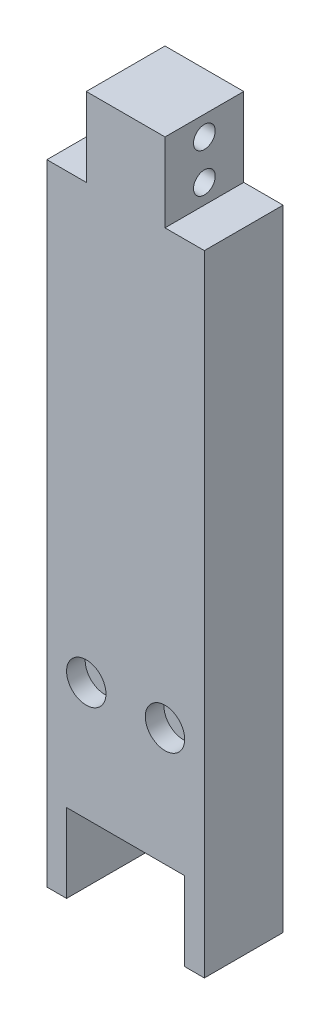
ISO-10303-21;
HEADER;
FILE_DESCRIPTION(('STEP AP214'),'2;1');
FILE_NAME('part.step','',(''),(''),'','','');
FILE_SCHEMA(('AUTOMOTIVE_DESIGN { 1 0 10303 214 1 1 1 1 }'));
ENDSEC;
DATA;
#1=APPLICATION_CONTEXT('core data for automotive mechanical design processes');
#2=APPLICATION_PROTOCOL_DEFINITION('international standard','automotive_design',2000,#1);
#3=PRODUCT_CONTEXT('',#1,'mechanical');
#4=PRODUCT('Part','Part','',(#3));
#5=PRODUCT_RELATED_PRODUCT_CATEGORY('part','',(#4));
#6=PRODUCT_DEFINITION_FORMATION('','',#4);
#7=PRODUCT_DEFINITION_CONTEXT('part definition',#1,'design');
#8=PRODUCT_DEFINITION('design','',#6,#7);
#9=PRODUCT_DEFINITION_SHAPE('','',#8);
#10=(LENGTH_UNIT() NAMED_UNIT(*) SI_UNIT(.MILLI.,.METRE.));
#11=(NAMED_UNIT(*) PLANE_ANGLE_UNIT() SI_UNIT($,.RADIAN.));
#12=(NAMED_UNIT(*) SI_UNIT($,.STERADIAN.) SOLID_ANGLE_UNIT());
#13=UNCERTAINTY_MEASURE_WITH_UNIT(LENGTH_MEASURE(1.E-05),#10,'distance_accuracy_value','');
#14=(GEOMETRIC_REPRESENTATION_CONTEXT(3) GLOBAL_UNCERTAINTY_ASSIGNED_CONTEXT((#13)) GLOBAL_UNIT_ASSIGNED_CONTEXT((#10,
#11,#12)) REPRESENTATION_CONTEXT('',''));
#15=CARTESIAN_POINT('',(0.,0.,0.));
#16=DIRECTION('',(0.,0.,1.));
#17=DIRECTION('',(1.,0.,0.));
#18=AXIS2_PLACEMENT_3D('',#15,#16,#17);
#19=CARTESIAN_POINT('',(12.7,-76.2,12.7));
#20=DIRECTION('',(0.,1.,0.));
#21=DIRECTION('',(0.,0.,1.));
#22=AXIS2_PLACEMENT_3D('',#19,#20,#21);
#23=PLANE('',#22);
#24=DIRECTION('',(1.,0.,0.));
#25=VECTOR('',#24,1.);
#26=CARTESIAN_POINT('',(12.7,-76.2,0.));
#27=LINE('',#26,#25);
#28=CARTESIAN_POINT('',(-12.7,-76.2,0.));
#29=VERTEX_POINT('',#28);
#30=CARTESIAN_POINT('',(-9.525,-76.2,0.));
#31=VERTEX_POINT('',#30);
#32=EDGE_CURVE('E165',#29,#31,#27,.T.);
#33=ORIENTED_EDGE('',*,*,#32,.T.);
#34=DIRECTION('',(0.,0.,-1.));
#35=VECTOR('',#34,1.);
#36=CARTESIAN_POINT('',(-9.525,-76.2,12.7));
#37=LINE('',#36,#35);
#38=CARTESIAN_POINT('',(-9.525,-76.2,12.7));
#39=VERTEX_POINT('',#38);
#40=EDGE_CURVE('E254',#39,#31,#37,.T.);
#41=ORIENTED_EDGE('',*,*,#40,.F.);
#42=DIRECTION('',(1.,0.,0.));
#43=VECTOR('',#42,1.);
#44=CARTESIAN_POINT('',(12.7,-76.2,12.7));
#45=LINE('',#44,#43);
#46=CARTESIAN_POINT('',(-12.7,-76.2,12.7));
#47=VERTEX_POINT('',#46);
#48=EDGE_CURVE('E115',#47,#39,#45,.T.);
#49=ORIENTED_EDGE('',*,*,#48,.F.);
#50=DIRECTION('',(0.,0.,-1.));
#51=VECTOR('',#50,1.);
#52=CARTESIAN_POINT('',(-12.7,-76.2,12.7));
#53=LINE('',#52,#51);
#54=EDGE_CURVE('E13',#47,#29,#53,.T.);
#55=ORIENTED_EDGE('',*,*,#54,.T.);
#56=EDGE_LOOP('',(#33,#41,#49,#55));
#57=FACE_BOUND('',#56,.T.);
#58=ADVANCED_FACE('F49',(#57),#23,.F.);
#59=CARTESIAN_POINT('',(-12.7,25.4,12.7));
#60=DIRECTION('',(1.,0.,0.));
#61=DIRECTION('',(0.,0.,-1.));
#62=AXIS2_PLACEMENT_3D('',#59,#60,#61);
#63=PLANE('',#62);
#64=DIRECTION('',(0.,-1.,0.));
#65=VECTOR('',#64,1.);
#66=CARTESIAN_POINT('',(-12.7,25.4,0.));
#67=LINE('',#66,#65);
#68=CARTESIAN_POINT('',(-12.7,25.4,0.));
#69=VERTEX_POINT('',#68);
#70=EDGE_CURVE('E160',#69,#29,#67,.T.);
#71=ORIENTED_EDGE('',*,*,#70,.T.);
#72=ORIENTED_EDGE('',*,*,#54,.F.);
#73=DIRECTION('',(0.,-1.,0.));
#74=VECTOR('',#73,1.);
#75=CARTESIAN_POINT('',(-12.7,25.4,12.7));
#76=LINE('',#75,#74);
#77=CARTESIAN_POINT('',(-12.7,25.4,12.7));
#78=VERTEX_POINT('',#77);
#79=EDGE_CURVE('E178',#78,#47,#76,.T.);
#80=ORIENTED_EDGE('',*,*,#79,.F.);
#81=DIRECTION('',(0.,0.,-1.));
#82=VECTOR('',#81,1.);
#83=CARTESIAN_POINT('',(-12.7,25.4,12.7));
#84=LINE('',#83,#82);
#85=EDGE_CURVE('E156',#78,#69,#84,.T.);
#86=ORIENTED_EDGE('',*,*,#85,.T.);
#87=EDGE_LOOP('',(#71,#72,#80,#86));
#88=FACE_BOUND('',#87,.T.);
#89=ADVANCED_FACE('F51',(#88),#63,.F.);
#90=CARTESIAN_POINT('',(9.525,-76.2,12.7));
#91=VERTEX_POINT('',#90);
#92=CARTESIAN_POINT('',(12.7,-76.2,12.7));
#93=VERTEX_POINT('',#92);
#94=EDGE_CURVE('E217',#91,#93,#45,.T.);
#95=ORIENTED_EDGE('',*,*,#94,.F.);
#96=DIRECTION('',(0.,0.,1.));
#97=VECTOR('',#96,1.);
#98=CARTESIAN_POINT('',(9.525,-76.2,12.7));
#99=LINE('',#98,#97);
#100=CARTESIAN_POINT('',(9.525,-76.2,0.));
#101=VERTEX_POINT('',#100);
#102=EDGE_CURVE('E251',#101,#91,#99,.T.);
#103=ORIENTED_EDGE('',*,*,#102,.F.);
#104=CARTESIAN_POINT('',(12.7,-76.2,0.));
#105=VERTEX_POINT('',#104);
#106=EDGE_CURVE('E163',#101,#105,#27,.T.);
#107=ORIENTED_EDGE('',*,*,#106,.T.);
#108=DIRECTION('',(0.,0.,-1.));
#109=VECTOR('',#108,1.);
#110=CARTESIAN_POINT('',(12.7,-76.2,12.7));
#111=LINE('',#110,#109);
#112=EDGE_CURVE('E58',#93,#105,#111,.T.);
#113=ORIENTED_EDGE('',*,*,#112,.F.);
#114=EDGE_LOOP('',(#95,#103,#107,#113));
#115=FACE_BOUND('',#114,.T.);
#116=ADVANCED_FACE('F309',(#115),#23,.F.);
#117=CARTESIAN_POINT('',(12.7,25.4,12.7));
#118=DIRECTION('',(-1.,0.,0.));
#119=DIRECTION('',(0.,0.,1.));
#120=AXIS2_PLACEMENT_3D('',#117,#118,#119);
#121=PLANE('',#120);
#122=DIRECTION('',(0.,1.,0.));
#123=VECTOR('',#122,1.);
#124=CARTESIAN_POINT('',(12.7,25.4,0.));
#125=LINE('',#124,#123);
#126=CARTESIAN_POINT('',(12.7,25.4,0.));
#127=VERTEX_POINT('',#126);
#128=EDGE_CURVE('E168',#105,#127,#125,.T.);
#129=ORIENTED_EDGE('',*,*,#128,.T.);
#130=DIRECTION('',(0.,0.,-1.));
#131=VECTOR('',#130,1.);
#132=CARTESIAN_POINT('',(12.7,25.4,12.7));
#133=LINE('',#132,#131);
#134=CARTESIAN_POINT('',(12.7,25.4,12.7));
#135=VERTEX_POINT('',#134);
#136=EDGE_CURVE('E185',#135,#127,#133,.T.);
#137=ORIENTED_EDGE('',*,*,#136,.F.);
#138=DIRECTION('',(0.,1.,0.));
#139=VECTOR('',#138,1.);
#140=CARTESIAN_POINT('',(12.7,25.4,12.7));
#141=LINE('',#140,#139);
#142=EDGE_CURVE('E195',#93,#135,#141,.T.);
#143=ORIENTED_EDGE('',*,*,#142,.F.);
#144=ORIENTED_EDGE('',*,*,#112,.T.);
#145=EDGE_LOOP('',(#129,#137,#143,#144));
#146=FACE_BOUND('',#145,.T.);
#147=ADVANCED_FACE('F193',(#146),#121,.F.);
#148=CARTESIAN_POINT('',(6.35,25.4,12.7));
#149=DIRECTION('',(0.,-1.,0.));
#150=DIRECTION('',(0.,0.,-1.));
#151=AXIS2_PLACEMENT_3D('',#148,#149,#150);
#152=PLANE('',#151);
#153=DIRECTION('',(-1.,0.,0.));
#154=VECTOR('',#153,1.);
#155=CARTESIAN_POINT('',(6.35,25.4,0.));
#156=LINE('',#155,#154);
#157=CARTESIAN_POINT('',(6.35,25.4,0.));
#158=VERTEX_POINT('',#157);
#159=EDGE_CURVE('E170',#127,#158,#156,.T.);
#160=ORIENTED_EDGE('',*,*,#159,.T.);
#161=DIRECTION('',(0.,0.,-1.));
#162=VECTOR('',#161,1.);
#163=CARTESIAN_POINT('',(6.35,25.4,12.7));
#164=LINE('',#163,#162);
#165=CARTESIAN_POINT('',(6.35,25.4,12.7));
#166=VERTEX_POINT('',#165);
#167=EDGE_CURVE('E182',#166,#158,#164,.T.);
#168=ORIENTED_EDGE('',*,*,#167,.F.);
#169=DIRECTION('',(-1.,0.,0.));
#170=VECTOR('',#169,1.);
#171=CARTESIAN_POINT('',(6.35,25.4,12.7));
#172=LINE('',#171,#170);
#173=EDGE_CURVE('E212',#135,#166,#172,.T.);
#174=ORIENTED_EDGE('',*,*,#173,.F.);
#175=ORIENTED_EDGE('',*,*,#136,.T.);
#176=EDGE_LOOP('',(#160,#168,#174,#175));
#177=FACE_BOUND('',#176,.T.);
#178=ADVANCED_FACE('F208',(#177),#152,.F.);
#179=CARTESIAN_POINT('',(6.35,38.1,12.7));
#180=DIRECTION('',(-1.,0.,0.));
#181=DIRECTION('',(0.,-1.,0.));
#182=AXIS2_PLACEMENT_3D('',#179,#180,#181);
#183=PLANE('',#182);
#184=CARTESIAN_POINT('',(6.35,28.575,6.35));
#185=DIRECTION('',(1.,0.,0.));
#186=DIRECTION('',(0.,1.,0.));
#187=AXIS2_PLACEMENT_3D('',#184,#185,#186);
#188=CIRCLE('',#187,1.7526);
#189=CARTESIAN_POINT('',(6.35,30.3276,6.35));
#190=VERTEX_POINT('',#189);
#191=EDGE_CURVE('E225',#190,#190,#188,.T.);
#192=ORIENTED_EDGE('',*,*,#191,.F.);
#193=EDGE_LOOP('',(#192));
#194=FACE_BOUND('',#193,.T.);
#195=CARTESIAN_POINT('',(6.35,34.9242400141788,6.35));
#196=DIRECTION('',(1.,0.,0.));
#197=DIRECTION('',(0.,1.,0.));
#198=AXIS2_PLACEMENT_3D('',#195,#196,#197);
#199=CIRCLE('',#198,1.7526);
#200=CARTESIAN_POINT('',(6.35,36.6768400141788,6.35));
#201=VERTEX_POINT('',#200);
#202=EDGE_CURVE('E219',#201,#201,#199,.T.);
#203=ORIENTED_EDGE('',*,*,#202,.F.);
#204=EDGE_LOOP('',(#203));
#205=FACE_BOUND('',#204,.T.);
#206=DIRECTION('',(0.,1.,0.));
#207=VECTOR('',#206,1.);
#208=CARTESIAN_POINT('',(6.35,38.1,0.));
#209=LINE('',#208,#207);
#210=CARTESIAN_POINT('',(6.35,38.1,0.));
#211=VERTEX_POINT('',#210);
#212=EDGE_CURVE('E172',#158,#211,#209,.T.);
#213=ORIENTED_EDGE('',*,*,#212,.T.);
#214=DIRECTION('',(0.,0.,-1.));
#215=VECTOR('',#214,1.);
#216=CARTESIAN_POINT('',(6.35,38.1,12.7));
#217=LINE('',#216,#215);
#218=CARTESIAN_POINT('',(6.35,38.1,12.7));
#219=VERTEX_POINT('',#218);
#220=EDGE_CURVE('E151',#219,#211,#217,.T.);
#221=ORIENTED_EDGE('',*,*,#220,.F.);
#222=DIRECTION('',(0.,1.,0.));
#223=VECTOR('',#222,1.);
#224=CARTESIAN_POINT('',(6.35,38.1,12.7));
#225=LINE('',#224,#223);
#226=EDGE_CURVE('E139',#166,#219,#225,.T.);
#227=ORIENTED_EDGE('',*,*,#226,.F.);
#228=ORIENTED_EDGE('',*,*,#167,.T.);
#229=EDGE_LOOP('',(#213,#221,#227,#228));
#230=FACE_BOUND('',#229,.T.);
#231=ADVANCED_FACE('F211',(#194,#205,#230),#183,.F.);
#232=CARTESIAN_POINT('',(6.35,38.1,12.7));
#233=DIRECTION('',(0.,-1.,0.));
#234=DIRECTION('',(0.,0.,-1.));
#235=AXIS2_PLACEMENT_3D('',#232,#233,#234);
#236=PLANE('',#235);
#237=DIRECTION('',(-1.,0.,0.));
#238=VECTOR('',#237,1.);
#239=CARTESIAN_POINT('',(6.35,38.1,0.));
#240=LINE('',#239,#238);
#241=CARTESIAN_POINT('',(-6.35,38.1,0.));
#242=VERTEX_POINT('',#241);
#243=EDGE_CURVE('E148',#211,#242,#240,.T.);
#244=ORIENTED_EDGE('',*,*,#243,.T.);
#245=DIRECTION('',(0.,0.,-1.));
#246=VECTOR('',#245,1.);
#247=CARTESIAN_POINT('',(-6.35,38.1,12.7));
#248=LINE('',#247,#246);
#249=CARTESIAN_POINT('',(-6.35,38.1,12.7));
#250=VERTEX_POINT('',#249);
#251=EDGE_CURVE('E145',#250,#242,#248,.T.);
#252=ORIENTED_EDGE('',*,*,#251,.F.);
#253=DIRECTION('',(-1.,0.,0.));
#254=VECTOR('',#253,1.);
#255=CARTESIAN_POINT('',(6.35,38.1,12.7));
#256=LINE('',#255,#254);
#257=EDGE_CURVE('E132',#219,#250,#256,.T.);
#258=ORIENTED_EDGE('',*,*,#257,.F.);
#259=ORIENTED_EDGE('',*,*,#220,.T.);
#260=EDGE_LOOP('',(#244,#252,#258,#259));
#261=FACE_BOUND('',#260,.T.);
#262=ADVANCED_FACE('F146',(#261),#236,.F.);
#263=CARTESIAN_POINT('',(-6.35,38.1,12.7));
#264=DIRECTION('',(1.,0.,0.));
#265=DIRECTION('',(0.,1.,0.));
#266=AXIS2_PLACEMENT_3D('',#263,#264,#265);
#267=PLANE('',#266);
#268=CARTESIAN_POINT('',(-6.35,28.575,6.35));
#269=DIRECTION('',(1.,0.,0.));
#270=DIRECTION('',(0.,1.,0.));
#271=AXIS2_PLACEMENT_3D('',#268,#269,#270);
#272=CIRCLE('',#271,1.7526);
#273=CARTESIAN_POINT('',(-6.35,30.3276,6.35));
#274=VERTEX_POINT('',#273);
#275=EDGE_CURVE('E222',#274,#274,#272,.T.);
#276=ORIENTED_EDGE('',*,*,#275,.T.);
#277=EDGE_LOOP('',(#276));
#278=FACE_BOUND('',#277,.T.);
#279=CARTESIAN_POINT('',(-6.35,34.9242400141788,6.35));
#280=DIRECTION('',(1.,0.,0.));
#281=DIRECTION('',(0.,1.,0.));
#282=AXIS2_PLACEMENT_3D('',#279,#280,#281);
#283=CIRCLE('',#282,1.7526);
#284=CARTESIAN_POINT('',(-6.35,36.6768400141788,6.35));
#285=VERTEX_POINT('',#284);
#286=EDGE_CURVE('E164',#285,#285,#283,.T.);
#287=ORIENTED_EDGE('',*,*,#286,.T.);
#288=EDGE_LOOP('',(#287));
#289=FACE_BOUND('',#288,.T.);
#290=DIRECTION('',(0.,-1.,0.));
#291=VECTOR('',#290,1.);
#292=CARTESIAN_POINT('',(-6.35,38.1,0.));
#293=LINE('',#292,#291);
#294=CARTESIAN_POINT('',(-6.35,25.4,0.));
#295=VERTEX_POINT('',#294);
#296=EDGE_CURVE('E175',#242,#295,#293,.T.);
#297=ORIENTED_EDGE('',*,*,#296,.T.);
#298=DIRECTION('',(0.,0.,-1.));
#299=VECTOR('',#298,1.);
#300=CARTESIAN_POINT('',(-6.35,25.4,12.7));
#301=LINE('',#300,#299);
#302=CARTESIAN_POINT('',(-6.35,25.4,12.7));
#303=VERTEX_POINT('',#302);
#304=EDGE_CURVE('E152',#303,#295,#301,.T.);
#305=ORIENTED_EDGE('',*,*,#304,.F.);
#306=DIRECTION('',(0.,-1.,0.));
#307=VECTOR('',#306,1.);
#308=CARTESIAN_POINT('',(-6.35,38.1,12.7));
#309=LINE('',#308,#307);
#310=EDGE_CURVE('E136',#250,#303,#309,.T.);
#311=ORIENTED_EDGE('',*,*,#310,.F.);
#312=ORIENTED_EDGE('',*,*,#251,.T.);
#313=EDGE_LOOP('',(#297,#305,#311,#312));
#314=FACE_BOUND('',#313,.T.);
#315=ADVANCED_FACE('F154',(#278,#289,#314),#267,.F.);
#316=CARTESIAN_POINT('',(-6.35,25.4,12.7));
#317=DIRECTION('',(0.,-1.,0.));
#318=DIRECTION('',(0.,0.,-1.));
#319=AXIS2_PLACEMENT_3D('',#316,#317,#318);
#320=PLANE('',#319);
#321=DIRECTION('',(-1.,0.,0.));
#322=VECTOR('',#321,1.);
#323=CARTESIAN_POINT('',(-6.35,25.4,0.));
#324=LINE('',#323,#322);
#325=EDGE_CURVE('E107',#295,#69,#324,.T.);
#326=ORIENTED_EDGE('',*,*,#325,.T.);
#327=ORIENTED_EDGE('',*,*,#85,.F.);
#328=DIRECTION('',(-1.,0.,0.));
#329=VECTOR('',#328,1.);
#330=CARTESIAN_POINT('',(-6.35,25.4,12.7));
#331=LINE('',#330,#329);
#332=EDGE_CURVE('E74',#303,#78,#331,.T.);
#333=ORIENTED_EDGE('',*,*,#332,.F.);
#334=ORIENTED_EDGE('',*,*,#304,.T.);
#335=EDGE_LOOP('',(#326,#327,#333,#334));
#336=FACE_BOUND('',#335,.T.);
#337=ADVANCED_FACE('F288',(#336),#320,.F.);
#338=CARTESIAN_POINT('',(0.,0.,12.7));
#339=DIRECTION('',(0.,0.,-1.));
#340=DIRECTION('',(-1.,0.,0.));
#341=AXIS2_PLACEMENT_3D('',#338,#339,#340);
#342=PLANE('',#341);
#343=CARTESIAN_POINT('',(6.35,-44.45,12.7));
#344=DIRECTION('',(0.,0.,1.));
#345=DIRECTION('',(1.,0.,0.));
#346=AXIS2_PLACEMENT_3D('',#343,#344,#345);
#347=CIRCLE('',#346,3.175);
#348=CARTESIAN_POINT('',(9.525,-44.45,12.7));
#349=VERTEX_POINT('',#348);
#350=EDGE_CURVE('E271',#349,#349,#347,.T.);
#351=ORIENTED_EDGE('',*,*,#350,.F.);
#352=EDGE_LOOP('',(#351));
#353=FACE_BOUND('',#352,.T.);
#354=CARTESIAN_POINT('',(-6.35,-44.45,12.7));
#355=DIRECTION('',(0.,0.,1.));
#356=DIRECTION('',(1.,0.,0.));
#357=AXIS2_PLACEMENT_3D('',#354,#355,#356);
#358=CIRCLE('',#357,3.175);
#359=CARTESIAN_POINT('',(-3.175,-44.45,12.7));
#360=VERTEX_POINT('',#359);
#361=EDGE_CURVE('E265',#360,#360,#358,.T.);
#362=ORIENTED_EDGE('',*,*,#361,.F.);
#363=EDGE_LOOP('',(#362));
#364=FACE_BOUND('',#363,.T.);
#365=ORIENTED_EDGE('',*,*,#48,.T.);
#366=DIRECTION('',(0.,-1.,0.));
#367=VECTOR('',#366,1.);
#368=CARTESIAN_POINT('',(-9.525,-63.5,12.7));
#369=LINE('',#368,#367);
#370=CARTESIAN_POINT('',(-9.525,-63.5,12.7));
#371=VERTEX_POINT('',#370);
#372=EDGE_CURVE('E248',#371,#39,#369,.T.);
#373=ORIENTED_EDGE('',*,*,#372,.F.);
#374=DIRECTION('',(-1.,0.,0.));
#375=VECTOR('',#374,1.);
#376=CARTESIAN_POINT('',(-9.525,-63.5,12.7));
#377=LINE('',#376,#375);
#378=CARTESIAN_POINT('',(9.525,-63.5,12.7));
#379=VERTEX_POINT('',#378);
#380=EDGE_CURVE('E242',#379,#371,#377,.T.);
#381=ORIENTED_EDGE('',*,*,#380,.F.);
#382=DIRECTION('',(0.,-1.,0.));
#383=VECTOR('',#382,1.);
#384=CARTESIAN_POINT('',(9.525,-63.5,12.7));
#385=LINE('',#384,#383);
#386=EDGE_CURVE('E245',#379,#91,#385,.T.);
#387=ORIENTED_EDGE('',*,*,#386,.T.);
#388=ORIENTED_EDGE('',*,*,#94,.T.);
#389=ORIENTED_EDGE('',*,*,#142,.T.);
#390=ORIENTED_EDGE('',*,*,#173,.T.);
#391=ORIENTED_EDGE('',*,*,#226,.T.);
#392=ORIENTED_EDGE('',*,*,#257,.T.);
#393=ORIENTED_EDGE('',*,*,#310,.T.);
#394=ORIENTED_EDGE('',*,*,#332,.T.);
#395=ORIENTED_EDGE('',*,*,#79,.T.);
#396=EDGE_LOOP('',(#365,#373,#381,#387,#388,#389,#390,#391,#392,#393,#394,#395));
#397=FACE_BOUND('',#396,.T.);
#398=ADVANCED_FACE('F134',(#353,#364,#397),#342,.F.);
#399=CARTESIAN_POINT('',(0.,0.,0.));
#400=DIRECTION('',(0.,0.,-1.));
#401=DIRECTION('',(-1.,0.,0.));
#402=AXIS2_PLACEMENT_3D('',#399,#400,#401);
#403=PLANE('',#402);
#404=DIRECTION('',(0.,-1.,0.));
#405=VECTOR('',#404,1.);
#406=CARTESIAN_POINT('',(-9.525,-63.5,0.));
#407=LINE('',#406,#405);
#408=CARTESIAN_POINT('',(-9.525,-63.5,0.));
#409=VERTEX_POINT('',#408);
#410=EDGE_CURVE('E239',#409,#31,#407,.T.);
#411=ORIENTED_EDGE('',*,*,#410,.T.);
#412=ORIENTED_EDGE('',*,*,#32,.F.);
#413=ORIENTED_EDGE('',*,*,#70,.F.);
#414=ORIENTED_EDGE('',*,*,#325,.F.);
#415=ORIENTED_EDGE('',*,*,#296,.F.);
#416=ORIENTED_EDGE('',*,*,#243,.F.);
#417=ORIENTED_EDGE('',*,*,#212,.F.);
#418=ORIENTED_EDGE('',*,*,#159,.F.);
#419=ORIENTED_EDGE('',*,*,#128,.F.);
#420=ORIENTED_EDGE('',*,*,#106,.F.);
#421=DIRECTION('',(0.,-1.,0.));
#422=VECTOR('',#421,1.);
#423=CARTESIAN_POINT('',(9.525,-63.5,0.));
#424=LINE('',#423,#422);
#425=CARTESIAN_POINT('',(9.525,-63.5,0.));
#426=VERTEX_POINT('',#425);
#427=EDGE_CURVE('E241',#426,#101,#424,.T.);
#428=ORIENTED_EDGE('',*,*,#427,.F.);
#429=DIRECTION('',(1.,0.,0.));
#430=VECTOR('',#429,1.);
#431=CARTESIAN_POINT('',(-9.525,-63.5,0.));
#432=LINE('',#431,#430);
#433=EDGE_CURVE('E262',#409,#426,#432,.T.);
#434=ORIENTED_EDGE('',*,*,#433,.F.);
#435=EDGE_LOOP('',(#411,#412,#413,#414,#415,#416,#417,#418,#419,#420,#428,#434));
#436=FACE_BOUND('',#435,.T.);
#437=ADVANCED_FACE('F202',(#436),#403,.T.);
#438=CARTESIAN_POINT('',(-6.35,34.9242400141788,6.35));
#439=DIRECTION('',(1.,0.,0.));
#440=DIRECTION('',(0.,1.,0.));
#441=AXIS2_PLACEMENT_3D('',#438,#439,#440);
#442=CYLINDRICAL_SURFACE('',#441,1.7526);
#443=ORIENTED_EDGE('',*,*,#286,.F.);
#444=EDGE_LOOP('',(#443));
#445=FACE_BOUND('',#444,.T.);
#446=ORIENTED_EDGE('',*,*,#202,.T.);
#447=EDGE_LOOP('',(#446));
#448=FACE_BOUND('',#447,.T.);
#449=ADVANCED_FACE('F380',(#445,#448),#442,.F.);
#450=CARTESIAN_POINT('',(-6.35,28.575,6.35));
#451=DIRECTION('',(1.,0.,0.));
#452=DIRECTION('',(0.,1.,0.));
#453=AXIS2_PLACEMENT_3D('',#450,#451,#452);
#454=CYLINDRICAL_SURFACE('',#453,1.7526);
#455=ORIENTED_EDGE('',*,*,#275,.F.);
#456=EDGE_LOOP('',(#455));
#457=FACE_BOUND('',#456,.T.);
#458=ORIENTED_EDGE('',*,*,#191,.T.);
#459=EDGE_LOOP('',(#458));
#460=FACE_BOUND('',#459,.T.);
#461=ADVANCED_FACE('F385',(#457,#460),#454,.F.);
#462=CARTESIAN_POINT('',(0.,-63.5,0.));
#463=DIRECTION('',(0.,-1.,0.));
#464=DIRECTION('',(0.,0.,-1.));
#465=AXIS2_PLACEMENT_3D('',#462,#463,#464);
#466=PLANE('',#465);
#467=DIRECTION('',(0.,0.,-1.));
#468=VECTOR('',#467,1.);
#469=CARTESIAN_POINT('',(-9.525,-63.5,12.7));
#470=LINE('',#469,#468);
#471=EDGE_CURVE('E65',#371,#409,#470,.T.);
#472=ORIENTED_EDGE('',*,*,#471,.T.);
#473=ORIENTED_EDGE('',*,*,#433,.T.);
#474=DIRECTION('',(0.,0.,1.));
#475=VECTOR('',#474,1.);
#476=CARTESIAN_POINT('',(9.525,-63.5,12.7));
#477=LINE('',#476,#475);
#478=EDGE_CURVE('E259',#426,#379,#477,.T.);
#479=ORIENTED_EDGE('',*,*,#478,.T.);
#480=ORIENTED_EDGE('',*,*,#380,.T.);
#481=EDGE_LOOP('',(#472,#473,#479,#480));
#482=FACE_BOUND('',#481,.T.);
#483=CARTESIAN_POINT('',(4.7625,-63.5,6.35));
#484=DIRECTION('',(0.,-1.,0.));
#485=DIRECTION('',(0.,0.,-1.));
#486=AXIS2_PLACEMENT_3D('',#483,#484,#485);
#487=CIRCLE('',#486,3.175);
#488=CARTESIAN_POINT('',(4.7625,-63.5,3.175));
#489=VERTEX_POINT('',#488);
#490=EDGE_CURVE('E53',#489,#489,#487,.F.);
#491=ORIENTED_EDGE('',*,*,#490,.T.);
#492=EDGE_LOOP('',(#491));
#493=FACE_BOUND('',#492,.T.);
#494=CARTESIAN_POINT('',(-4.7625,-63.5,6.35));
#495=DIRECTION('',(0.,-1.,0.));
#496=DIRECTION('',(0.,0.,-1.));
#497=AXIS2_PLACEMENT_3D('',#494,#495,#496);
#498=CIRCLE('',#497,3.175);
#499=CARTESIAN_POINT('',(-4.7625,-63.5,3.175));
#500=VERTEX_POINT('',#499);
#501=EDGE_CURVE('E236',#500,#500,#498,.F.);
#502=ORIENTED_EDGE('',*,*,#501,.T.);
#503=EDGE_LOOP('',(#502));
#504=FACE_BOUND('',#503,.T.);
#505=ADVANCED_FACE('F330',(#482,#493,#504),#466,.T.);
#506=CARTESIAN_POINT('',(-9.525,-63.5,12.7));
#507=DIRECTION('',(-1.,0.,0.));
#508=DIRECTION('',(0.,0.,1.));
#509=AXIS2_PLACEMENT_3D('',#506,#507,#508);
#510=PLANE('',#509);
#511=ORIENTED_EDGE('',*,*,#40,.T.);
#512=ORIENTED_EDGE('',*,*,#410,.F.);
#513=ORIENTED_EDGE('',*,*,#471,.F.);
#514=ORIENTED_EDGE('',*,*,#372,.T.);
#515=EDGE_LOOP('',(#511,#512,#513,#514));
#516=FACE_BOUND('',#515,.T.);
#517=ADVANCED_FACE('F339',(#516),#510,.F.);
#518=CARTESIAN_POINT('',(9.525,-63.5,12.7));
#519=DIRECTION('',(1.,0.,0.));
#520=DIRECTION('',(0.,0.,-1.));
#521=AXIS2_PLACEMENT_3D('',#518,#519,#520);
#522=PLANE('',#521);
#523=ORIENTED_EDGE('',*,*,#102,.T.);
#524=ORIENTED_EDGE('',*,*,#386,.F.);
#525=ORIENTED_EDGE('',*,*,#478,.F.);
#526=ORIENTED_EDGE('',*,*,#427,.T.);
#527=EDGE_LOOP('',(#523,#524,#525,#526));
#528=FACE_BOUND('',#527,.T.);
#529=ADVANCED_FACE('F327',(#528),#522,.F.);
#530=CARTESIAN_POINT('',(-4.7625,-60.499999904,6.35));
#531=DIRECTION('',(0.,-1.,0.));
#532=DIRECTION('',(0.,0.,-1.));
#533=AXIS2_PLACEMENT_3D('',#530,#531,#532);
#534=PLANE('',#533);
#535=CARTESIAN_POINT('',(-4.7625,-60.499999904,6.35));
#536=DIRECTION('',(0.,-1.,0.));
#537=DIRECTION('',(0.,0.,-1.));
#538=AXIS2_PLACEMENT_3D('',#535,#536,#537);
#539=CIRCLE('',#538,3.175);
#540=CARTESIAN_POINT('',(-4.7625,-60.499999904,3.175));
#541=VERTEX_POINT('',#540);
#542=EDGE_CURVE('E228',#541,#541,#539,.T.);
#543=ORIENTED_EDGE('',*,*,#542,.T.);
#544=EDGE_LOOP('',(#543));
#545=FACE_BOUND('',#544,.T.);
#546=ADVANCED_FACE('F404',(#545),#534,.T.);
#547=CARTESIAN_POINT('',(-4.7625,-60.499999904,6.35));
#548=DIRECTION('',(0.,-1.,0.));
#549=DIRECTION('',(0.,0.,-1.));
#550=AXIS2_PLACEMENT_3D('',#547,#548,#549);
#551=CYLINDRICAL_SURFACE('',#550,3.175);
#552=ORIENTED_EDGE('',*,*,#542,.F.);
#553=EDGE_LOOP('',(#552));
#554=FACE_BOUND('',#553,.T.);
#555=ORIENTED_EDGE('',*,*,#501,.F.);
#556=EDGE_LOOP('',(#555));
#557=FACE_BOUND('',#556,.T.);
#558=ADVANCED_FACE('F408',(#554,#557),#551,.F.);
#559=CARTESIAN_POINT('',(4.7625,-60.499999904,6.35));
#560=DIRECTION('',(0.,-1.,0.));
#561=DIRECTION('',(0.,0.,-1.));
#562=AXIS2_PLACEMENT_3D('',#559,#560,#561);
#563=PLANE('',#562);
#564=CARTESIAN_POINT('',(4.7625,-60.499999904,6.35));
#565=DIRECTION('',(0.,-1.,0.));
#566=DIRECTION('',(0.,0.,-1.));
#567=AXIS2_PLACEMENT_3D('',#564,#565,#566);
#568=CIRCLE('',#567,3.175);
#569=CARTESIAN_POINT('',(4.7625,-60.499999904,3.175));
#570=VERTEX_POINT('',#569);
#571=EDGE_CURVE('E233',#570,#570,#568,.T.);
#572=ORIENTED_EDGE('',*,*,#571,.T.);
#573=EDGE_LOOP('',(#572));
#574=FACE_BOUND('',#573,.T.);
#575=ADVANCED_FACE('F303',(#574),#563,.T.);
#576=CARTESIAN_POINT('',(4.7625,-60.499999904,6.35));
#577=DIRECTION('',(0.,-1.,0.));
#578=DIRECTION('',(0.,0.,-1.));
#579=AXIS2_PLACEMENT_3D('',#576,#577,#578);
#580=CYLINDRICAL_SURFACE('',#579,3.175);
#581=ORIENTED_EDGE('',*,*,#571,.F.);
#582=EDGE_LOOP('',(#581));
#583=FACE_BOUND('',#582,.T.);
#584=ORIENTED_EDGE('',*,*,#490,.F.);
#585=EDGE_LOOP('',(#584));
#586=FACE_BOUND('',#585,.T.);
#587=ADVANCED_FACE('F294',(#583,#586),#580,.F.);
#588=CARTESIAN_POINT('',(-6.35,-44.45,9.7));
#589=DIRECTION('',(0.,0.,1.));
#590=DIRECTION('',(1.,0.,0.));
#591=AXIS2_PLACEMENT_3D('',#588,#589,#590);
#592=CYLINDRICAL_SURFACE('',#591,3.175);
#593=CARTESIAN_POINT('',(-6.35,-44.45,9.7));
#594=DIRECTION('',(0.,0.,1.));
#595=DIRECTION('',(1.,0.,0.));
#596=AXIS2_PLACEMENT_3D('',#593,#594,#595);
#597=CIRCLE('',#596,3.175);
#598=CARTESIAN_POINT('',(-3.175,-44.45,9.7));
#599=VERTEX_POINT('',#598);
#600=EDGE_CURVE('E257',#599,#599,#597,.T.);
#601=ORIENTED_EDGE('',*,*,#600,.F.);
#602=EDGE_LOOP('',(#601));
#603=FACE_BOUND('',#602,.T.);
#604=ORIENTED_EDGE('',*,*,#361,.T.);
#605=EDGE_LOOP('',(#604));
#606=FACE_BOUND('',#605,.T.);
#607=ADVANCED_FACE('F292',(#603,#606),#592,.F.);
#608=CARTESIAN_POINT('',(-6.35,-44.45,9.7));
#609=DIRECTION('',(0.,0.,1.));
#610=DIRECTION('',(1.,0.,0.));
#611=AXIS2_PLACEMENT_3D('',#608,#609,#610);
#612=PLANE('',#611);
#613=ORIENTED_EDGE('',*,*,#600,.T.);
#614=EDGE_LOOP('',(#613));
#615=FACE_BOUND('',#614,.T.);
#616=ADVANCED_FACE('F282',(#615),#612,.T.);
#617=CARTESIAN_POINT('',(6.35,-44.45,9.7));
#618=DIRECTION('',(0.,0.,1.));
#619=DIRECTION('',(1.,0.,0.));
#620=AXIS2_PLACEMENT_3D('',#617,#618,#619);
#621=CYLINDRICAL_SURFACE('',#620,3.175);
#622=CARTESIAN_POINT('',(6.35,-44.45,9.7));
#623=DIRECTION('',(0.,0.,1.));
#624=DIRECTION('',(1.,0.,0.));
#625=AXIS2_PLACEMENT_3D('',#622,#623,#624);
#626=CIRCLE('',#625,3.175);
#627=CARTESIAN_POINT('',(9.525,-44.45,9.7));
#628=VERTEX_POINT('',#627);
#629=EDGE_CURVE('E268',#628,#628,#626,.T.);
#630=ORIENTED_EDGE('',*,*,#629,.F.);
#631=EDGE_LOOP('',(#630));
#632=FACE_BOUND('',#631,.T.);
#633=ORIENTED_EDGE('',*,*,#350,.T.);
#634=EDGE_LOOP('',(#633));
#635=FACE_BOUND('',#634,.T.);
#636=ADVANCED_FACE('F279',(#632,#635),#621,.F.);
#637=CARTESIAN_POINT('',(6.35,-44.45,9.7));
#638=DIRECTION('',(0.,0.,1.));
#639=DIRECTION('',(1.,0.,0.));
#640=AXIS2_PLACEMENT_3D('',#637,#638,#639);
#641=PLANE('',#640);
#642=ORIENTED_EDGE('',*,*,#629,.T.);
#643=EDGE_LOOP('',(#642));
#644=FACE_BOUND('',#643,.T.);
#645=ADVANCED_FACE('F277',(#644),#641,.T.);
#646=CLOSED_SHELL('',(#58,#89,#116,#147,#178,#231,#262,#315,#337,#398,#437,#449,#461,#505,#517,
#529,#546,#558,#575,#587,#607,#616,#636,#645));
#647=MANIFOLD_SOLID_BREP('B2',#646);
#648=ADVANCED_BREP_SHAPE_REPRESENTATION('',(#18,#647),#14);
#649=SHAPE_DEFINITION_REPRESENTATION(#9,#648);
ENDSEC;
END-ISO-10303-21;
